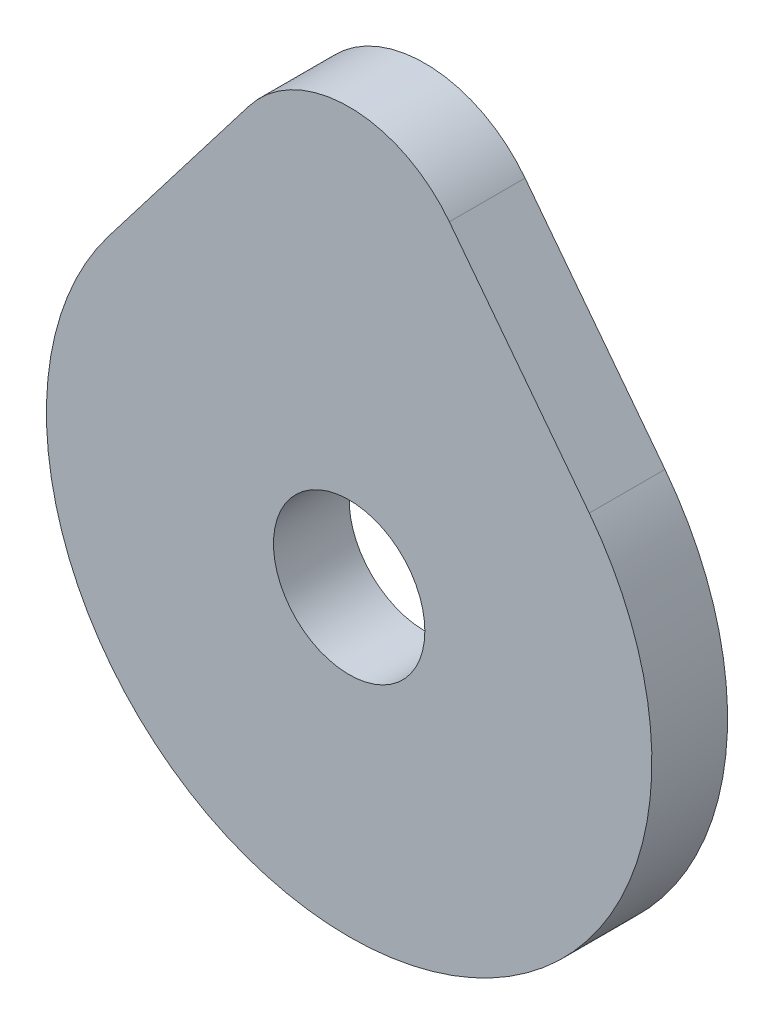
from build123d import *

# Parameters (mm, degrees)
SKETCH1_R           = 3.175
BOSS_EXTRUDE1_DEPTH = 3.175


with BuildPart() as part:
    # Sketch1 → Boss-Extrude1 (new body)
    with BuildSketch(Plane.XY):
        with BuildLine():
            Line((-4.203601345, 15.380910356), (-10.074181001, 7.733102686))
            ThreePointArc((-10.074181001, 7.733102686), (0, -12.7), (10.074181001, 7.733102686))
            Line((10.074181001, 7.733102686), (4.203601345, 15.380910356))
            ThreePointArc((4.203601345, 15.380910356), (0, 17.453421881), (-4.203601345, 15.380910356))
        make_face()
        Circle(SKETCH1_R, mode=Mode.SUBTRACT)
    extrude(amount=BOSS_EXTRUDE1_DEPTH)


solid = part.part
